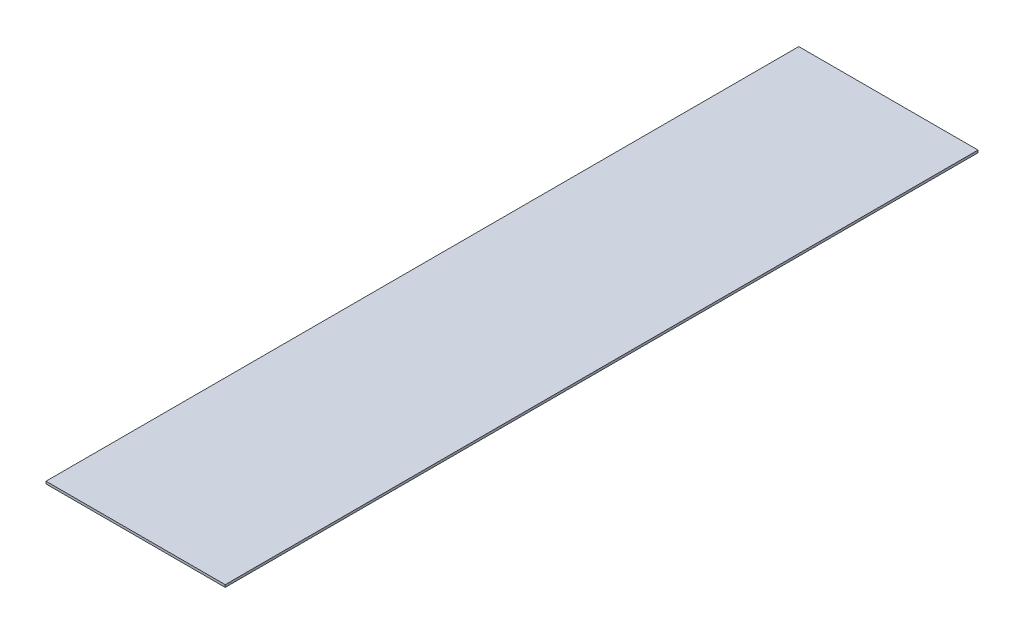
from build123d import *

# Parameters (mm, degrees)
SKETCH2_W      = 7.6193848
SKETCH2_H      = 32.004
EXTRUDE1_DEPTH = 0.1016


with BuildPart() as part:
    # Sketch2 → Extrude1 (new body)
    with BuildSketch(Plane(origin=(0, 0, 0), x_dir=(1, 0, 0), z_dir=(0, 1, 0))):
        with Locations((0.509982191, 1.891760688)):
            Rectangle(SKETCH2_W, SKETCH2_H)
    extrude(amount=EXTRUDE1_DEPTH)


solid = part.part
